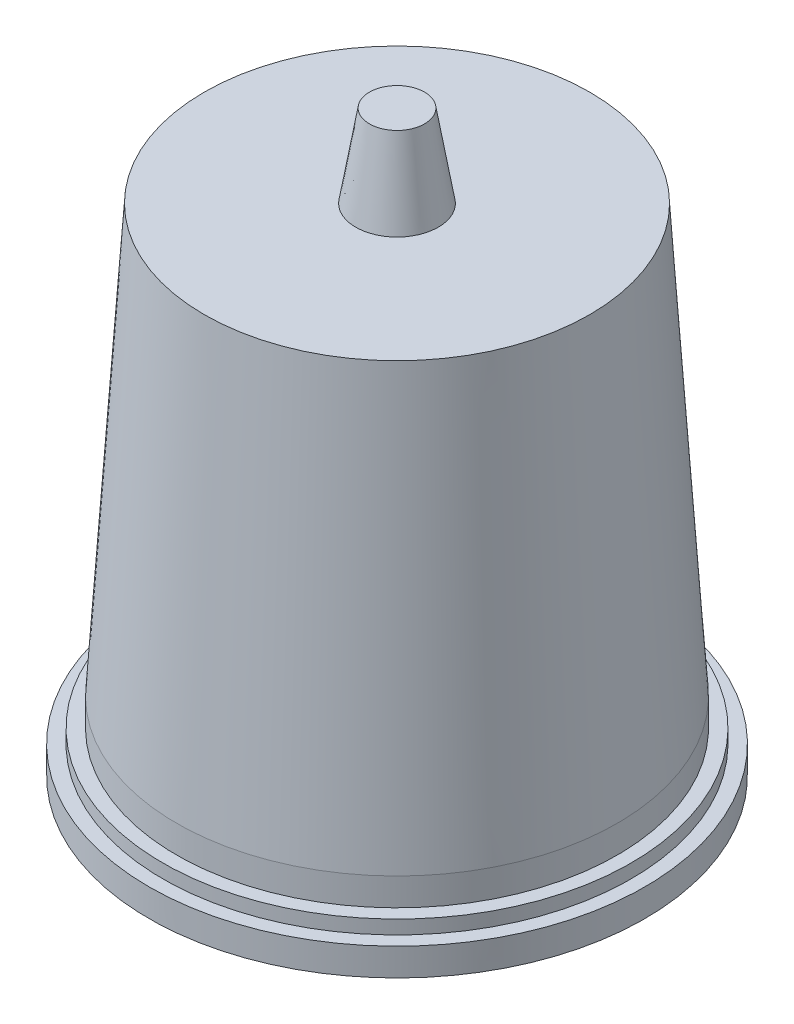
from build123d import *

# Parameters (mm, degrees)
CORTAR_EXTRUIR3_DEPTH = 123.780291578


with BuildPart() as part:
    # Croquis1 → Revoluci_n1 (revolve)
    with BuildSketch(Plane.XY, mode=Mode.PRIVATE) as revoluci_n1_sk:
        with BuildLine():
            Line((0, 5), (0, 0))
            ThreePointArc((0, 0), (-22.638462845, 1.253834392), (-45, 5))
            Line((-45, 5), (-45, 10))
            Line((-45, 10), (-42.5, 10))
            Line((-42.5, 10), (-42.5, 12.5))
            Line((-42.5, 12.5), (-40, 12.5))
            Line((-40, 12.5), (-40, 17.5))
            Line((-40, 17.5), (-35, 95))
            Line((-35, 95), (-7.5, 95))
            Line((-7.5, 95), (-5, 110))
            Line((-5, 110), (0, 110))
            Line((0, 110), (0, 15))
            Line((0, 15), (0, 5))
        make_face()
    revolve(revoluci_n1_sk.sketch.rotate(Axis((0, 0, 0), (0, 1, 0)), 270), axis=Axis((0, 0, 0), (0, 1, 0)))

    # Croquis2 → Cortar-Extruir3 (cut, through all)
    with BuildSketch(Plane(origin=(0, 5, 0), x_dir=(1, 0, 0), z_dir=(0, 1, 0))):
        with BuildLine():
            Line((-17.320508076, 10), (-38.97114317, 22.5))
            ThreePointArc((-38.97114317, 22.5), (0, 45), (38.97114317, 22.5))
            Line((38.97114317, 22.5), (17.320508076, 10))
            ThreePointArc((17.320508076, 10), (0, 20), (-17.320508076, 10))
        make_face()
        with BuildLine():
            Line((17.498239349, 10.679963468), (38.285697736, 22.681608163))
            ThreePointArc((38.285697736, 22.681608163), (0, 44.5), (-38.285697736, 22.681608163))
            Line((-38.285697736, 22.681608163), (-17.498239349, 10.679963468))
            ThreePointArc((-17.498239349, 10.679963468), (0, 20.5), (17.498239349, 10.679963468))
        make_face(mode=Mode.SUBTRACT)
    extrude(amount=-CORTAR_EXTRUIR3_DEPTH, mode=Mode.SUBTRACT)


solid = part.part
